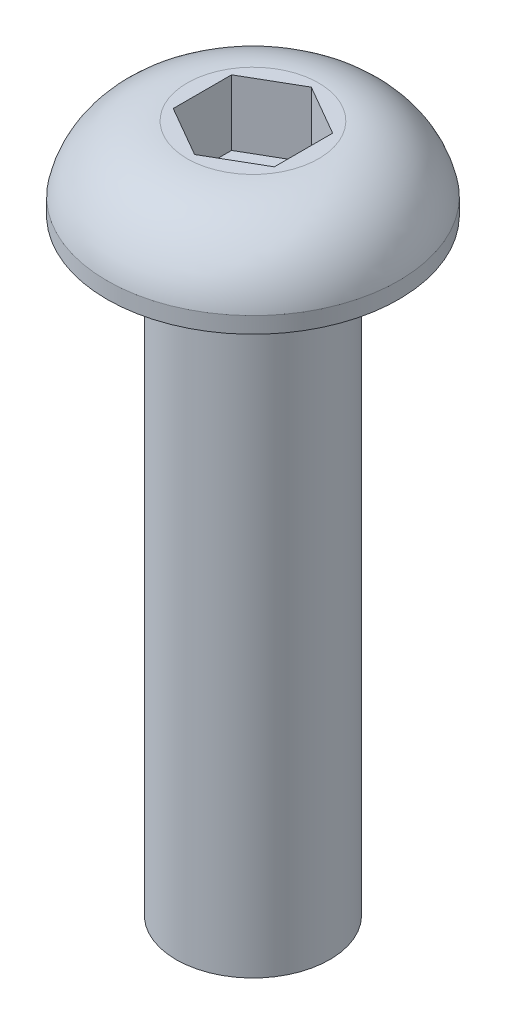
from build123d import *

# Parameters (mm, degrees)
HEXCUT_DEPTH = 2.0574


with BuildPart() as part:
    # Sketch1 → Screw (revolve)
    with BuildSketch(Plane.XY, mode=Mode.PRIVATE) as screw_sk:
        with BuildLine():
            Line((0, 0), (2.06375, 0))
            ThreePointArc((2.06375, 0), (3.690716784, -0.57963445), (4.5847, -2.0574))
            Line((4.5847, -2.0574), (4.5847, -2.5654))
            Line((4.5847, -2.5654), (2.413, -2.5654))
            Line((2.413, -2.5654), (2.413, -21.6154))
            Line((2.413, -21.6154), (0, -21.6154))
            Line((0, -21.6154), (0, 0))
        make_face()
    revolve(screw_sk.sketch.rotate(Axis((0, 25.4, 0), (0, -1, 0)), 90), axis=Axis((0, 25.4, 0), (0, -1, 0)))

    # Sketch2 → HexCut (cut)
    with BuildSketch(Plane(origin=(0, 0, 0), x_dir=(-1, 0, 0), z_dir=(0, 1, 0))):
        Polygon((-1.5875, -0.916543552), (-1.5875, 0.916543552), (0, 1.833087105), (1.5875, 0.916543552), (1.5875, -0.916543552), (0, -1.833087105), align=None)
    extrude(amount=-HEXCUT_DEPTH, mode=Mode.SUBTRACT)


solid = part.part
